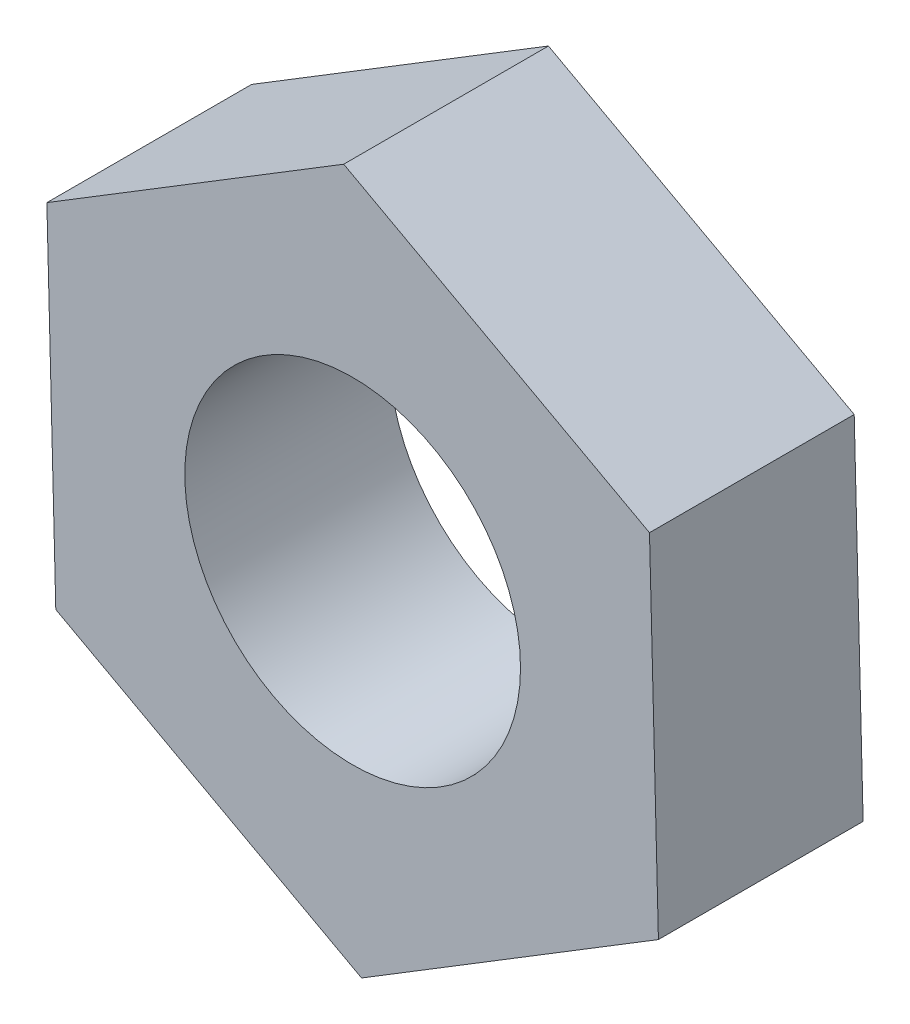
ISO-10303-21;
HEADER;
FILE_DESCRIPTION(('STEP AP214'),'2;1');
FILE_NAME('part.step','',(''),(''),'','','');
FILE_SCHEMA(('AUTOMOTIVE_DESIGN { 1 0 10303 214 1 1 1 1 }'));
ENDSEC;
DATA;
#1=APPLICATION_CONTEXT('core data for automotive mechanical design processes');
#2=APPLICATION_PROTOCOL_DEFINITION('international standard','automotive_design',2000,#1);
#3=PRODUCT_CONTEXT('',#1,'mechanical');
#4=PRODUCT('Part','Part','',(#3));
#5=PRODUCT_RELATED_PRODUCT_CATEGORY('part','',(#4));
#6=PRODUCT_DEFINITION_FORMATION('','',#4);
#7=PRODUCT_DEFINITION_CONTEXT('part definition',#1,'design');
#8=PRODUCT_DEFINITION('design','',#6,#7);
#9=PRODUCT_DEFINITION_SHAPE('','',#8);
#10=(LENGTH_UNIT() NAMED_UNIT(*) SI_UNIT(.MILLI.,.METRE.));
#11=(NAMED_UNIT(*) PLANE_ANGLE_UNIT() SI_UNIT($,.RADIAN.));
#12=(NAMED_UNIT(*) SI_UNIT($,.STERADIAN.) SOLID_ANGLE_UNIT());
#13=UNCERTAINTY_MEASURE_WITH_UNIT(LENGTH_MEASURE(1.E-05),#10,'distance_accuracy_value','');
#14=(GEOMETRIC_REPRESENTATION_CONTEXT(3) GLOBAL_UNCERTAINTY_ASSIGNED_CONTEXT((#13)) GLOBAL_UNIT_ASSIGNED_CONTEXT((#10,
#11,#12)) REPRESENTATION_CONTEXT('',''));
#15=CARTESIAN_POINT('',(0.,0.,0.));
#16=DIRECTION('',(0.,0.,1.));
#17=DIRECTION('',(1.,0.,0.));
#18=AXIS2_PLACEMENT_3D('',#15,#16,#17);
#19=CARTESIAN_POINT('',(8.93092141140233,16.4278553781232,6.35));
#20=DIRECTION('',(0.,0.,1.));
#21=DIRECTION('',(1.,0.,0.));
#22=AXIS2_PLACEMENT_3D('',#19,#20,#21);
#23=PLANE('',#22);
#24=DIRECTION('',(-0.0256449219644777,0.999671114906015,0.));
#25=VECTOR('',#24,1.);
#26=CARTESIAN_POINT('',(9.48462672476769,-5.15626988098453,6.35));
#27=LINE('',#26,#25);
#28=CARTESIAN_POINT('',(9.48462672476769,-5.15626988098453,6.35));
#29=VERTEX_POINT('',#28);
#30=CARTESIAN_POINT('',(9.20777406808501,5.63579274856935,6.35));
#31=VERTEX_POINT('',#30);
#32=EDGE_CURVE('E112',#29,#31,#27,.T.);
#33=ORIENTED_EDGE('',*,*,#32,.T.);
#34=DIRECTION('',(-0.878563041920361,0.477626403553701,0.));
#35=VECTOR('',#34,1.);
#36=CARTESIAN_POINT('',(9.20777406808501,5.63579274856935,6.35));
#37=LINE('',#36,#35);
#38=CARTESIAN_POINT('',(-0.276852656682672,10.7920626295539,6.35));
#39=VERTEX_POINT('',#38);
#40=EDGE_CURVE('E93',#31,#39,#37,.T.);
#41=ORIENTED_EDGE('',*,*,#40,.T.);
#42=DIRECTION('',(-0.852918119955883,-0.522044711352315,0.));
#43=VECTOR('',#42,1.);
#44=CARTESIAN_POINT('',(-0.276852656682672,10.7920626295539,6.35));
#45=LINE('',#44,#43);
#46=CARTESIAN_POINT('',(-9.48462672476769,5.15626988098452,6.35));
#47=VERTEX_POINT('',#46);
#48=EDGE_CURVE('E115',#39,#47,#45,.T.);
#49=ORIENTED_EDGE('',*,*,#48,.T.);
#50=DIRECTION('',(0.0256449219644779,-0.999671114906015,0.));
#51=VECTOR('',#50,1.);
#52=CARTESIAN_POINT('',(-9.48462672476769,5.15626988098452,6.35));
#53=LINE('',#52,#51);
#54=CARTESIAN_POINT('',(-9.20777406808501,-5.63579274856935,6.35));
#55=VERTEX_POINT('',#54);
#56=EDGE_CURVE('E117',#47,#55,#53,.T.);
#57=ORIENTED_EDGE('',*,*,#56,.T.);
#58=DIRECTION('',(0.878563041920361,-0.477626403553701,0.));
#59=VECTOR('',#58,1.);
#60=CARTESIAN_POINT('',(-9.20777406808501,-5.63579274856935,6.35));
#61=LINE('',#60,#59);
#62=CARTESIAN_POINT('',(0.276852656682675,-10.7920626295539,6.35));
#63=VERTEX_POINT('',#62);
#64=EDGE_CURVE('E46',#55,#63,#61,.T.);
#65=ORIENTED_EDGE('',*,*,#64,.T.);
#66=DIRECTION('',(0.852918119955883,0.522044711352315,0.));
#67=VECTOR('',#66,1.);
#68=CARTESIAN_POINT('',(0.276852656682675,-10.7920626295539,6.35));
#69=LINE('',#68,#67);
#70=EDGE_CURVE('E41',#63,#29,#69,.T.);
#71=ORIENTED_EDGE('',*,*,#70,.T.);
#72=EDGE_LOOP('',(#33,#41,#49,#57,#65,#71));
#73=FACE_BOUND('',#72,.T.);
#74=CARTESIAN_POINT('',(0.,0.,6.35));
#75=DIRECTION('',(0.,0.,1.));
#76=DIRECTION('',(1.,0.,0.));
#77=AXIS2_PLACEMENT_3D('',#74,#75,#76);
#78=CIRCLE('',#77,5.207);
#79=CARTESIAN_POINT('',(5.207,0.,6.35));
#80=VERTEX_POINT('',#79);
#81=EDGE_CURVE('E98',#80,#80,#78,.T.);
#82=ORIENTED_EDGE('',*,*,#81,.F.);
#83=EDGE_LOOP('',(#82));
#84=FACE_BOUND('',#83,.T.);
#85=ADVANCED_FACE('F26',(#73,#84),#23,.T.);
#86=CARTESIAN_POINT('',(8.93092141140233,16.4278553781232,0.));
#87=DIRECTION('',(0.,0.,1.));
#88=DIRECTION('',(1.,0.,0.));
#89=AXIS2_PLACEMENT_3D('',#86,#87,#88);
#90=PLANE('',#89);
#91=DIRECTION('',(-0.0256449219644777,0.999671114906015,0.));
#92=VECTOR('',#91,1.);
#93=CARTESIAN_POINT('',(9.48462672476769,-5.15626988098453,0.));
#94=LINE('',#93,#92);
#95=CARTESIAN_POINT('',(9.48462672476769,-5.15626988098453,0.));
#96=VERTEX_POINT('',#95);
#97=CARTESIAN_POINT('',(9.20777406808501,5.63579274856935,0.));
#98=VERTEX_POINT('',#97);
#99=EDGE_CURVE('E84',#96,#98,#94,.T.);
#100=ORIENTED_EDGE('',*,*,#99,.F.);
#101=DIRECTION('',(0.852918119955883,0.522044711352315,0.));
#102=VECTOR('',#101,1.);
#103=CARTESIAN_POINT('',(0.276852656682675,-10.7920626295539,0.));
#104=LINE('',#103,#102);
#105=CARTESIAN_POINT('',(0.276852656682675,-10.7920626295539,0.));
#106=VERTEX_POINT('',#105);
#107=EDGE_CURVE('E110',#106,#96,#104,.T.);
#108=ORIENTED_EDGE('',*,*,#107,.F.);
#109=DIRECTION('',(0.878563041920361,-0.477626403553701,0.));
#110=VECTOR('',#109,1.);
#111=CARTESIAN_POINT('',(-9.20777406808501,-5.63579274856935,0.));
#112=LINE('',#111,#110);
#113=CARTESIAN_POINT('',(-9.20777406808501,-5.63579274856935,0.));
#114=VERTEX_POINT('',#113);
#115=EDGE_CURVE('E108',#114,#106,#112,.T.);
#116=ORIENTED_EDGE('',*,*,#115,.F.);
#117=DIRECTION('',(0.0256449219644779,-0.999671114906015,0.));
#118=VECTOR('',#117,1.);
#119=CARTESIAN_POINT('',(-9.48462672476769,5.15626988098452,0.));
#120=LINE('',#119,#118);
#121=CARTESIAN_POINT('',(-9.48462672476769,5.15626988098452,0.));
#122=VERTEX_POINT('',#121);
#123=EDGE_CURVE('E106',#122,#114,#120,.T.);
#124=ORIENTED_EDGE('',*,*,#123,.F.);
#125=DIRECTION('',(-0.852918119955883,-0.522044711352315,0.));
#126=VECTOR('',#125,1.);
#127=CARTESIAN_POINT('',(-0.276852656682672,10.7920626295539,0.));
#128=LINE('',#127,#126);
#129=CARTESIAN_POINT('',(-0.276852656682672,10.7920626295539,0.));
#130=VERTEX_POINT('',#129);
#131=EDGE_CURVE('E86',#130,#122,#128,.T.);
#132=ORIENTED_EDGE('',*,*,#131,.F.);
#133=DIRECTION('',(-0.878563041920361,0.477626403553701,0.));
#134=VECTOR('',#133,1.);
#135=CARTESIAN_POINT('',(9.20777406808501,5.63579274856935,0.));
#136=LINE('',#135,#134);
#137=EDGE_CURVE('E79',#98,#130,#136,.T.);
#138=ORIENTED_EDGE('',*,*,#137,.F.);
#139=EDGE_LOOP('',(#100,#108,#116,#124,#132,#138));
#140=FACE_BOUND('',#139,.T.);
#141=CARTESIAN_POINT('',(0.,0.,0.));
#142=DIRECTION('',(0.,0.,1.));
#143=DIRECTION('',(1.,0.,0.));
#144=AXIS2_PLACEMENT_3D('',#141,#142,#143);
#145=CIRCLE('',#144,5.207);
#146=CARTESIAN_POINT('',(5.207,0.,0.));
#147=VERTEX_POINT('',#146);
#148=EDGE_CURVE('E101',#147,#147,#145,.T.);
#149=ORIENTED_EDGE('',*,*,#148,.T.);
#150=EDGE_LOOP('',(#149));
#151=FACE_BOUND('',#150,.T.);
#152=ADVANCED_FACE('F80',(#140,#151),#90,.F.);
#153=CARTESIAN_POINT('',(9.48462672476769,-5.15626988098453,6.35));
#154=DIRECTION('',(-0.999671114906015,-0.0256449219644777,0.));
#155=DIRECTION('',(0.0256449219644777,-0.999671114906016,0.));
#156=AXIS2_PLACEMENT_3D('',#153,#154,#155);
#157=PLANE('',#156);
#158=ORIENTED_EDGE('',*,*,#99,.T.);
#159=DIRECTION('',(0.,0.,-1.));
#160=VECTOR('',#159,1.);
#161=CARTESIAN_POINT('',(9.20777406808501,5.63579274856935,6.35));
#162=LINE('',#161,#160);
#163=EDGE_CURVE('E11',#31,#98,#162,.T.);
#164=ORIENTED_EDGE('',*,*,#163,.F.);
#165=ORIENTED_EDGE('',*,*,#32,.F.);
#166=DIRECTION('',(0.,0.,-1.));
#167=VECTOR('',#166,1.);
#168=CARTESIAN_POINT('',(9.48462672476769,-5.15626988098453,6.35));
#169=LINE('',#168,#167);
#170=EDGE_CURVE('E97',#29,#96,#169,.T.);
#171=ORIENTED_EDGE('',*,*,#170,.T.);
#172=EDGE_LOOP('',(#158,#164,#165,#171));
#173=FACE_BOUND('',#172,.T.);
#174=ADVANCED_FACE('F28',(#173),#157,.F.);
#175=CARTESIAN_POINT('',(9.20777406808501,5.63579274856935,6.35));
#176=DIRECTION('',(-0.477626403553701,-0.878563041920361,0.));
#177=DIRECTION('',(0.878563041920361,-0.477626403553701,0.));
#178=AXIS2_PLACEMENT_3D('',#175,#176,#177);
#179=PLANE('',#178);
#180=ORIENTED_EDGE('',*,*,#137,.T.);
#181=DIRECTION('',(0.,0.,-1.));
#182=VECTOR('',#181,1.);
#183=CARTESIAN_POINT('',(-0.276852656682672,10.7920626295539,6.35));
#184=LINE('',#183,#182);
#185=EDGE_CURVE('E34',#39,#130,#184,.T.);
#186=ORIENTED_EDGE('',*,*,#185,.F.);
#187=ORIENTED_EDGE('',*,*,#40,.F.);
#188=ORIENTED_EDGE('',*,*,#163,.T.);
#189=EDGE_LOOP('',(#180,#186,#187,#188));
#190=FACE_BOUND('',#189,.T.);
#191=ADVANCED_FACE('F92',(#190),#179,.F.);
#192=CARTESIAN_POINT('',(-0.276852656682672,10.7920626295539,6.35));
#193=DIRECTION('',(0.522044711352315,-0.852918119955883,0.));
#194=DIRECTION('',(0.852918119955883,0.522044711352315,0.));
#195=AXIS2_PLACEMENT_3D('',#192,#193,#194);
#196=PLANE('',#195);
#197=ORIENTED_EDGE('',*,*,#131,.T.);
#198=DIRECTION('',(0.,0.,-1.));
#199=VECTOR('',#198,1.);
#200=CARTESIAN_POINT('',(-9.48462672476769,5.15626988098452,6.35));
#201=LINE('',#200,#199);
#202=EDGE_CURVE('E128',#47,#122,#201,.T.);
#203=ORIENTED_EDGE('',*,*,#202,.F.);
#204=ORIENTED_EDGE('',*,*,#48,.F.);
#205=ORIENTED_EDGE('',*,*,#185,.T.);
#206=EDGE_LOOP('',(#197,#203,#204,#205));
#207=FACE_BOUND('',#206,.T.);
#208=ADVANCED_FACE('F132',(#207),#196,.F.);
#209=CARTESIAN_POINT('',(-9.48462672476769,5.15626988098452,6.35));
#210=DIRECTION('',(0.999671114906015,0.0256449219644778,0.));
#211=DIRECTION('',(-0.0256449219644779,0.999671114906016,0.));
#212=AXIS2_PLACEMENT_3D('',#209,#210,#211);
#213=PLANE('',#212);
#214=ORIENTED_EDGE('',*,*,#123,.T.);
#215=DIRECTION('',(0.,0.,-1.));
#216=VECTOR('',#215,1.);
#217=CARTESIAN_POINT('',(-9.20777406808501,-5.63579274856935,6.35));
#218=LINE('',#217,#216);
#219=EDGE_CURVE('E125',#55,#114,#218,.T.);
#220=ORIENTED_EDGE('',*,*,#219,.F.);
#221=ORIENTED_EDGE('',*,*,#56,.F.);
#222=ORIENTED_EDGE('',*,*,#202,.T.);
#223=EDGE_LOOP('',(#214,#220,#221,#222));
#224=FACE_BOUND('',#223,.T.);
#225=ADVANCED_FACE('F138',(#224),#213,.F.);
#226=CARTESIAN_POINT('',(-9.20777406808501,-5.63579274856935,6.35));
#227=DIRECTION('',(0.477626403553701,0.878563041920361,0.));
#228=DIRECTION('',(-0.878563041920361,0.477626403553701,0.));
#229=AXIS2_PLACEMENT_3D('',#226,#227,#228);
#230=PLANE('',#229);
#231=ORIENTED_EDGE('',*,*,#115,.T.);
#232=DIRECTION('',(0.,0.,-1.));
#233=VECTOR('',#232,1.);
#234=CARTESIAN_POINT('',(0.276852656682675,-10.7920626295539,6.35));
#235=LINE('',#234,#233);
#236=EDGE_CURVE('E122',#63,#106,#235,.T.);
#237=ORIENTED_EDGE('',*,*,#236,.F.);
#238=ORIENTED_EDGE('',*,*,#64,.F.);
#239=ORIENTED_EDGE('',*,*,#219,.T.);
#240=EDGE_LOOP('',(#231,#237,#238,#239));
#241=FACE_BOUND('',#240,.T.);
#242=ADVANCED_FACE('F141',(#241),#230,.F.);
#243=CARTESIAN_POINT('',(0.276852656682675,-10.7920626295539,6.35));
#244=DIRECTION('',(-0.522044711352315,0.852918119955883,0.));
#245=DIRECTION('',(-0.852918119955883,-0.522044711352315,0.));
#246=AXIS2_PLACEMENT_3D('',#243,#244,#245);
#247=PLANE('',#246);
#248=ORIENTED_EDGE('',*,*,#107,.T.);
#249=ORIENTED_EDGE('',*,*,#170,.F.);
#250=ORIENTED_EDGE('',*,*,#70,.F.);
#251=ORIENTED_EDGE('',*,*,#236,.T.);
#252=EDGE_LOOP('',(#248,#249,#250,#251));
#253=FACE_BOUND('',#252,.T.);
#254=ADVANCED_FACE('F143',(#253),#247,.F.);
#255=CARTESIAN_POINT('',(0.,0.,6.35));
#256=DIRECTION('',(0.,0.,-1.));
#257=DIRECTION('',(-1.,0.,0.));
#258=AXIS2_PLACEMENT_3D('',#255,#256,#257);
#259=CYLINDRICAL_SURFACE('',#258,5.207);
#260=ORIENTED_EDGE('',*,*,#81,.T.);
#261=EDGE_LOOP('',(#260));
#262=FACE_BOUND('',#261,.T.);
#263=ORIENTED_EDGE('',*,*,#148,.F.);
#264=EDGE_LOOP('',(#263));
#265=FACE_BOUND('',#264,.T.);
#266=ADVANCED_FACE('F145',(#262,#265),#259,.F.);
#267=CLOSED_SHELL('',(#85,#152,#174,#191,#208,#225,#242,#254,#266));
#268=MANIFOLD_SOLID_BREP('B2',#267);
#269=ADVANCED_BREP_SHAPE_REPRESENTATION('',(#18,#268),#14);
#270=SHAPE_DEFINITION_REPRESENTATION(#9,#269);
ENDSEC;
END-ISO-10303-21;
